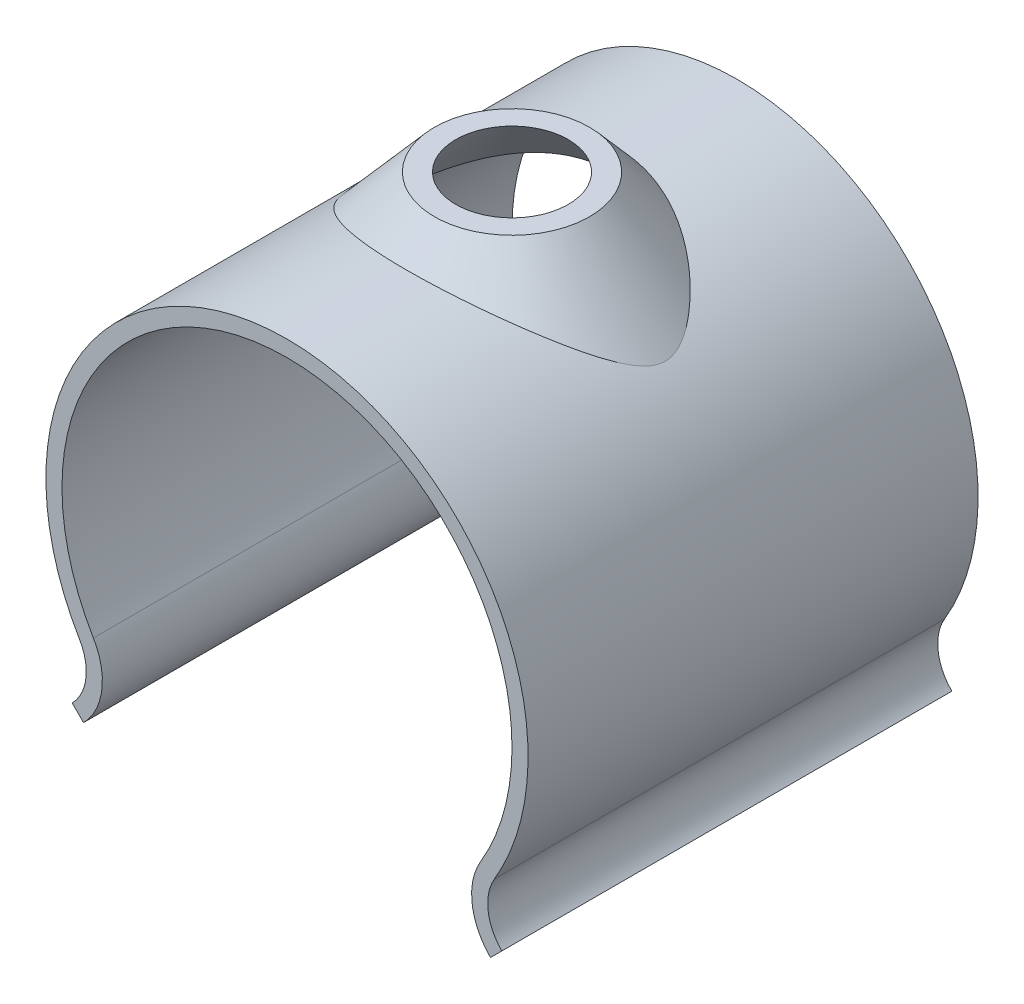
ISO-10303-21;
HEADER;
FILE_DESCRIPTION(('STEP AP214'),'2;1');
FILE_NAME('part.step','',(''),(''),'','','');
FILE_SCHEMA(('AUTOMOTIVE_DESIGN { 1 0 10303 214 1 1 1 1 }'));
ENDSEC;
DATA;
#1=APPLICATION_CONTEXT('core data for automotive mechanical design processes');
#2=APPLICATION_PROTOCOL_DEFINITION('international standard','automotive_design',2000,#1);
#3=PRODUCT_CONTEXT('',#1,'mechanical');
#4=PRODUCT('Part','Part','',(#3));
#5=PRODUCT_RELATED_PRODUCT_CATEGORY('part','',(#4));
#6=PRODUCT_DEFINITION_FORMATION('','',#4);
#7=PRODUCT_DEFINITION_CONTEXT('part definition',#1,'design');
#8=PRODUCT_DEFINITION('design','',#6,#7);
#9=PRODUCT_DEFINITION_SHAPE('','',#8);
#10=(LENGTH_UNIT() NAMED_UNIT(*) SI_UNIT(.MILLI.,.METRE.));
#11=(NAMED_UNIT(*) PLANE_ANGLE_UNIT() SI_UNIT($,.RADIAN.));
#12=(NAMED_UNIT(*) SI_UNIT($,.STERADIAN.) SOLID_ANGLE_UNIT());
#13=UNCERTAINTY_MEASURE_WITH_UNIT(LENGTH_MEASURE(1.E-05),#10,'distance_accuracy_value','');
#14=(GEOMETRIC_REPRESENTATION_CONTEXT(3) GLOBAL_UNCERTAINTY_ASSIGNED_CONTEXT((#13)) GLOBAL_UNIT_ASSIGNED_CONTEXT((#10,
#11,#12)) REPRESENTATION_CONTEXT('',''));
#15=CARTESIAN_POINT('',(0.,0.,0.));
#16=DIRECTION('',(0.,0.,1.));
#17=DIRECTION('',(1.,0.,0.));
#18=AXIS2_PLACEMENT_3D('',#15,#16,#17);
#19=CARTESIAN_POINT('',(0.,0.,11.1125));
#20=DIRECTION('',(0.,0.,-1.));
#21=DIRECTION('',(-1.,0.,0.));
#22=AXIS2_PLACEMENT_3D('',#19,#20,#21);
#23=CYLINDRICAL_SURFACE('',#22,11.1125);
#24=CARTESIAN_POINT('',(0.,0.,-11.1125));
#25=DIRECTION('',(0.,0.,-1.));
#26=DIRECTION('',(1.,0.,0.));
#27=AXIS2_PLACEMENT_3D('',#24,#25,#26);
#28=CIRCLE('',#27,11.1125);
#29=CARTESIAN_POINT('',(-9.56177074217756,-5.66217242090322,-11.1125));
#30=VERTEX_POINT('',#29);
#31=CARTESIAN_POINT('',(9.56177074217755,-5.66217242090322,-11.1125));
#32=VERTEX_POINT('',#31);
#33=EDGE_CURVE('E145',#30,#32,#28,.T.);
#34=ORIENTED_EDGE('',*,*,#33,.T.);
#35=DIRECTION('',(0.,0.,-1.));
#36=VECTOR('',#35,1.);
#37=CARTESIAN_POINT('',(9.56177074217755,-5.66217242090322,11.1125));
#38=LINE('',#37,#36);
#39=CARTESIAN_POINT('',(9.56177074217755,-5.66217242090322,11.1125));
#40=VERTEX_POINT('',#39);
#41=EDGE_CURVE('E156',#40,#32,#38,.T.);
#42=ORIENTED_EDGE('',*,*,#41,.F.);
#43=CARTESIAN_POINT('',(0.,0.,11.1125));
#44=DIRECTION('',(0.,0.,-1.));
#45=DIRECTION('',(1.,0.,0.));
#46=AXIS2_PLACEMENT_3D('',#43,#44,#45);
#47=CIRCLE('',#46,11.1125);
#48=CARTESIAN_POINT('',(-9.56177074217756,-5.66217242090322,11.1125));
#49=VERTEX_POINT('',#48);
#50=EDGE_CURVE('E182',#49,#40,#47,.T.);
#51=ORIENTED_EDGE('',*,*,#50,.F.);
#52=DIRECTION('',(0.,0.,-1.));
#53=VECTOR('',#52,1.);
#54=CARTESIAN_POINT('',(-9.56177074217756,-5.66217242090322,11.1125));
#55=LINE('',#54,#53);
#56=EDGE_CURVE('E159',#49,#30,#55,.T.);
#57=ORIENTED_EDGE('',*,*,#56,.T.);
#58=EDGE_LOOP('',(#34,#42,#51,#57));
#59=FACE_BOUND('',#58,.T.);
#60=CARTESIAN_POINT('',(-4.69885032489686,10.070176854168,-3.32137443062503));
#61=CARTESIAN_POINT('',(-4.51894106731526,10.1541328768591,-3.4494470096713));
#62=CARTESIAN_POINT('',(-4.33307176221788,10.2349816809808,-3.57105309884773));
#63=CARTESIAN_POINT('',(-3.94978434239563,10.3889102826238,-3.8004561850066));
#64=CARTESIAN_POINT('',(-3.75236343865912,10.4619881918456,-3.90824982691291));
#65=CARTESIAN_POINT('',(-3.34699256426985,10.5986331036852,-4.10855290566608));
#66=CARTESIAN_POINT('',(-3.1390525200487,10.6622088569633,-4.20107641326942));
#67=CARTESIAN_POINT('',(-2.71355634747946,10.7783507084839,-4.36937212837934));
#68=CARTESIAN_POINT('',(-2.49600361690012,10.8309206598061,-4.44515019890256));
#69=CARTESIAN_POINT('',(-2.10047526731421,10.913627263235,-4.56402933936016));
#70=CARTESIAN_POINT('',(-1.92405137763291,10.9461570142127,-4.61065313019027));
#71=CARTESIAN_POINT('',(-1.56715952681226,11.0029220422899,-4.69188318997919));
#72=CARTESIAN_POINT('',(-1.38669235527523,11.0271589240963,-4.72649178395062));
#73=CARTESIAN_POINT('',(-1.02295028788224,11.0668277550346,-4.78308248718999));
#74=CARTESIAN_POINT('',(-0.839677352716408,11.0822655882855,-4.80507303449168));
#75=CARTESIAN_POINT('',(-0.47148773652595,11.1040245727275,-4.83605619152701));
#76=CARTESIAN_POINT('',(-0.286571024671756,11.1103455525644,-4.84504855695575));
#77=CARTESIAN_POINT('',(0.0837987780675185,11.1137294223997,-4.84986335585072));
#78=CARTESIAN_POINT('',(0.269252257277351,11.1107783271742,-4.8456658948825));
#79=CARTESIAN_POINT('',(0.639012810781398,11.0956549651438,-4.82413991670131));
#80=CARTESIAN_POINT('',(0.823319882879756,11.083482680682,-4.80681137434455));
#81=CARTESIAN_POINT('',(1.18950320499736,11.0501832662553,-4.75934560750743));
#82=CARTESIAN_POINT('',(1.37137874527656,11.029053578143,-4.72920472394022));
#83=CARTESIAN_POINT('',(1.73144346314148,10.97828881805,-4.65665264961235));
#84=CARTESIAN_POINT('',(1.90963259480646,10.9486536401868,-4.61424130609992));
#85=CARTESIAN_POINT('',(2.25983214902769,10.8817423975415,-4.51823636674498));
#86=CARTESIAN_POINT('',(2.43188194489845,10.8445327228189,-4.46473986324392));
#87=CARTESIAN_POINT('',(2.77057723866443,10.7629901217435,-4.34710216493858));
#88=CARTESIAN_POINT('',(2.93722093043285,10.7186548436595,-4.28295745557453));
#89=CARTESIAN_POINT('',(3.42820149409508,10.5759646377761,-4.07563282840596));
#90=CARTESIAN_POINT('',(3.74363660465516,10.467915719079,-3.91754873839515));
#91=CARTESIAN_POINT('',(4.22043144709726,10.2815975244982,-3.64075521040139));
#92=CARTESIAN_POINT('',(4.39108447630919,10.2097569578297,-3.533204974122));
#93=CARTESIAN_POINT('',(4.72264600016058,10.0606782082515,-3.30732873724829));
#94=CARTESIAN_POINT('',(4.88355573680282,9.98344071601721,-3.18900411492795));
#95=CARTESIAN_POINT('',(5.19519054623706,9.82487820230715,-2.94194044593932));
#96=CARTESIAN_POINT('',(5.34590977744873,9.74355088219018,-2.8131955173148));
#97=CARTESIAN_POINT('',(5.63623209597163,9.57853971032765,-2.5452886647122));
#98=CARTESIAN_POINT('',(5.77584053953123,9.49485702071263,-2.4061318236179));
#99=CARTESIAN_POINT('',(6.05407481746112,9.32013381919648,-2.10404721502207));
#100=CARTESIAN_POINT('',(6.19160892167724,9.22907237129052,-1.94010432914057));
#101=CARTESIAN_POINT('',(6.38369761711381,9.09627220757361,-1.68191908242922));
#102=CARTESIAN_POINT('',(6.44531752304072,9.05266878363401,-1.59388282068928));
#103=CARTESIAN_POINT('',(6.56280246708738,8.96785949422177,-1.4129774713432));
#104=CARTESIAN_POINT('',(6.6186709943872,8.92665218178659,-1.32011136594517));
#105=CARTESIAN_POINT('',(6.72512367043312,8.84674858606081,-1.12488451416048));
#106=CARTESIAN_POINT('',(6.77541535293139,8.80821374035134,-1.02229440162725));
#107=CARTESIAN_POINT('',(6.86504109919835,8.73854016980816,-0.809962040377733));
#108=CARTESIAN_POINT('',(6.90438959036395,8.70739171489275,-0.700229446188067));
#109=CARTESIAN_POINT('',(6.96140594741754,8.66184521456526,-0.495966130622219));
#110=CARTESIAN_POINT('',(6.98181896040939,8.64535535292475,-0.402704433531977));
#111=CARTESIAN_POINT('',(7.01007492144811,8.62246241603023,-0.213152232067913));
#112=CARTESIAN_POINT('',(7.01794540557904,8.61603724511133,-0.116868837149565));
#113=CARTESIAN_POINT('',(7.01987237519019,8.61446759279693,0.0762667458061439));
#114=CARTESIAN_POINT('',(7.01388227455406,8.6193611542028,0.173119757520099));
#115=CARTESIAN_POINT('',(6.98900839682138,8.63954025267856,0.364091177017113));
#116=CARTESIAN_POINT('',(6.97009957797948,8.65484597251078,0.458203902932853));
#117=CARTESIAN_POINT('',(6.91011553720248,8.70287405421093,0.686848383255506));
#118=CARTESIAN_POINT('',(6.86272145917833,8.74045388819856,0.818626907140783));
#119=CARTESIAN_POINT('',(6.75265934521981,8.82576456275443,1.07218308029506));
#120=CARTESIAN_POINT('',(6.6899315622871,8.87353501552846,1.19391905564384));
#121=CARTESIAN_POINT('',(6.54690100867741,8.97967111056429,1.44120031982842));
#122=CARTESIAN_POINT('',(6.46544623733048,9.03862234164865,1.56581226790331));
#123=CARTESIAN_POINT('',(6.29305078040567,9.15949236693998,1.80685146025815));
#124=CARTESIAN_POINT('',(6.20209946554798,9.22141444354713,1.92326928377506));
#125=CARTESIAN_POINT('',(6.01232233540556,9.34625975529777,2.14934874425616));
#126=CARTESIAN_POINT('',(5.91348139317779,9.40918471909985,2.25899665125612));
#127=CARTESIAN_POINT('',(5.70902383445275,9.53462686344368,2.47204638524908));
#128=CARTESIAN_POINT('',(5.60340562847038,9.59714394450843,2.57544673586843));
#129=CARTESIAN_POINT('',(5.32671230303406,9.75454245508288,2.83111236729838));
#130=CARTESIAN_POINT('',(5.15132393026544,9.84850087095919,2.97931002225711));
#131=CARTESIAN_POINT('',(4.78682738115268,10.0307288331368,3.26185791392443));
#132=CARTESIAN_POINT('',(4.59771257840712,10.1189955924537,3.39620138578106));
#133=CARTESIAN_POINT('',(4.20691734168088,10.2875993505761,3.64992852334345));
#134=CARTESIAN_POINT('',(4.00526194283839,10.3679513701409,3.76934064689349));
#135=CARTESIAN_POINT('',(3.58987542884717,10.5189946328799,3.99210491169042));
#136=CARTESIAN_POINT('',(3.37614949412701,10.5896899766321,4.09546387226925));
#137=CARTESIAN_POINT('',(2.98538270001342,10.7054737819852,4.2638687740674));
#138=CARTESIAN_POINT('',(2.81047860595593,10.752786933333,4.33235765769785));
#139=CARTESIAN_POINT('',(2.45463090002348,10.8395553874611,4.45758041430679));
#140=CARTESIAN_POINT('',(2.27368862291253,10.8790124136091,4.51431686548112));
#141=CARTESIAN_POINT('',(1.90678554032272,10.9492779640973,4.61513950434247));
#142=CARTESIAN_POINT('',(1.72082805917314,10.9800920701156,4.6592338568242));
#143=CARTESIAN_POINT('',(1.34493976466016,11.03244282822,4.73404411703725));
#144=CARTESIAN_POINT('',(1.15500893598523,11.0539794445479,4.76475997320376));
#145=CARTESIAN_POINT('',(0.77165898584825,11.0873524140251,4.8123233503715));
#146=CARTESIAN_POINT('',(0.578227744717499,11.0991431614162,4.82910567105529));
#147=CARTESIAN_POINT('',(0.190296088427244,11.1125653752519,4.8482083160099));
#148=CARTESIAN_POINT('',(-0.00420432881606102,11.1141968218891,4.85052861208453));
#149=CARTESIAN_POINT('',(-0.392673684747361,11.1072593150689,4.84065694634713));
#150=CARTESIAN_POINT('',(-0.586642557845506,11.0986891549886,4.82846326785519));
#151=CARTESIAN_POINT('',(-0.972437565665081,11.0715587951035,4.78981942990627));
#152=CARTESIAN_POINT('',(-1.16426376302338,11.0529988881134,4.76336968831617));
#153=CARTESIAN_POINT('',(-1.53115836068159,11.007950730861,4.69905845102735));
#154=CARTESIAN_POINT('',(-1.70646772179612,10.9821000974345,4.66211344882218));
#155=CARTESIAN_POINT('',(-2.05302484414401,10.9226217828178,4.57691739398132));
#156=CARTESIAN_POINT('',(-2.22427120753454,10.8889914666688,4.52866251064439));
#157=CARTESIAN_POINT('',(-2.56173639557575,10.8145740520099,4.42156464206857));
#158=CARTESIAN_POINT('',(-2.7279570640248,10.7737896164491,4.36272559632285));
#159=CARTESIAN_POINT('',(-3.05484510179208,10.6857030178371,4.23515068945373));
#160=CARTESIAN_POINT('',(-3.21551006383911,10.6383980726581,4.1664106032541));
#161=CARTESIAN_POINT('',(-3.54755391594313,10.532617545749,4.0119284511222));
#162=CARTESIAN_POINT('',(-3.71824422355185,10.4734885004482,3.92515461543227));
#163=CARTESIAN_POINT('',(-4.05162396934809,10.3490899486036,3.74124457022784));
#164=CARTESIAN_POINT('',(-4.21431228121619,10.2838195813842,3.64410690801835));
#165=CARTESIAN_POINT('',(-4.53148271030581,10.1480597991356,3.44005049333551));
#166=CARTESIAN_POINT('',(-4.68595358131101,10.0775635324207,3.33311885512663));
#167=CARTESIAN_POINT('',(-4.98608034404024,9.93249355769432,3.11005393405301));
#168=CARTESIAN_POINT('',(-5.13173641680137,9.85791993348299,2.99392084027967));
#169=CARTESIAN_POINT('',(-5.3868790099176,9.72039158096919,2.77555507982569));
#170=CARTESIAN_POINT('',(-5.49797253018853,9.65792749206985,2.67488480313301));
#171=CARTESIAN_POINT('',(-5.71362961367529,9.53192926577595,2.46741705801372));
#172=CARTESIAN_POINT('',(-5.81819404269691,9.46839527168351,2.36062040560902));
#173=CARTESIAN_POINT('',(-6.01985784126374,9.34147322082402,2.14067427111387));
#174=CARTESIAN_POINT('',(-6.11697523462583,9.27808519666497,2.0275413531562));
#175=CARTESIAN_POINT('',(-6.30276736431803,9.15288381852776,1.79379054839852));
#176=CARTESIAN_POINT('',(-6.39144847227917,9.09106930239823,1.67317842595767));
#177=CARTESIAN_POINT('',(-6.54266393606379,8.98266072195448,1.44596268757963));
#178=CARTESIAN_POINT('',(-6.60699856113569,8.93536850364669,1.34090355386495));
#179=CARTESIAN_POINT('',(-6.72631027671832,8.84589974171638,1.12328159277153));
#180=CARTESIAN_POINT('',(-6.78128348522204,8.80372532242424,1.01071567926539));
#181=CARTESIAN_POINT('',(-6.87092109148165,8.73389160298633,0.79359178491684));
#182=CARTESIAN_POINT('',(-6.90736499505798,8.70501933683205,0.69018786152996));
#183=CARTESIAN_POINT('',(-6.96644976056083,8.65781133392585,0.477264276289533));
#184=CARTESIAN_POINT('',(-6.98913531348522,8.63944149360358,0.367765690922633));
#185=CARTESIAN_POINT('',(-7.01442198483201,8.61891918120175,0.164672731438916));
#186=CARTESIAN_POINT('',(-7.01986017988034,8.61447750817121,0.0716802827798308));
#187=CARTESIAN_POINT('',(-7.01793952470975,8.61604205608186,-0.114065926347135));
#188=CARTESIAN_POINT('',(-7.01058167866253,8.62204745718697,-0.206819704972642));
#189=CARTESIAN_POINT('',(-6.98093181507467,8.64607885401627,-0.411991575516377));
#190=CARTESIAN_POINT('',(-6.95540253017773,8.66670548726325,-0.523613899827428));
#191=CARTESIAN_POINT('',(-6.89054658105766,8.71835470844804,-0.740372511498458));
#192=CARTESIAN_POINT('',(-6.85116678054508,8.74941731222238,-0.845481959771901));
#193=CARTESIAN_POINT('',(-6.76467847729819,8.81644131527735,-1.04426378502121));
#194=CARTESIAN_POINT('',(-6.71802104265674,8.85210328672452,-1.1382416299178));
#195=CARTESIAN_POINT('',(-6.61797703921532,8.92714811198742,-1.32103374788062));
#196=CARTESIAN_POINT('',(-6.56458368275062,8.96653470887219,-1.4098426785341));
#197=CARTESIAN_POINT('',(-6.39639981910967,9.08805438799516,-1.66994994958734));
#198=CARTESIAN_POINT('',(-6.27374791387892,9.17343436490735,-1.83463055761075));
#199=CARTESIAN_POINT('',(-6.0397043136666,9.32873887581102,-2.11862051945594));
#200=CARTESIAN_POINT('',(-5.93099190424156,9.39832679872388,-2.24040316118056));
#201=CARTESIAN_POINT('',(-5.70522882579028,9.53706314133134,-2.4763274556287));
#202=CARTESIAN_POINT('',(-5.58817505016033,9.60621138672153,-2.59046623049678));
#203=CARTESIAN_POINT('',(-5.22576060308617,9.81101036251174,-2.92212951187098));
#204=CARTESIAN_POINT('',(-4.96902602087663,9.9440973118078,-3.12904359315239));
#205=CARTESIAN_POINT('',(-4.69885032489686,10.070176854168,-3.32137443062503));
#206=B_SPLINE_CURVE_WITH_KNOTS('',3,(#60,#61,#62,#63,#64,#65,#66,#67,#68,#69,#70,#71,#72,#73,
#74,#75,#76,#77,#78,#79,#80,#81,#82,#83,#84,#85,#86,#87,#88,#89,#90,#91,#92,#93,#94,#95,#96,#97,
#98,#99,#100,#101,#102,#103,#104,#105,#106,#107,#108,#109,#110,#111,#112,#113,#114,#115,#116,
#117,#118,#119,#120,#121,#122,#123,#124,#125,#126,#127,#128,#129,#130,#131,#132,#133,#134,#135,
#136,#137,#138,#139,#140,#141,#142,#143,#144,#145,#146,#147,#148,#149,#150,#151,#152,#153,#154,
#155,#156,#157,#158,#159,#160,#161,#162,#163,#164,#165,#166,#167,#168,#169,#170,#171,#172,#173,
#174,#175,#176,#177,#178,#179,#180,#181,#182,#183,#184,#185,#186,#187,#188,#189,#190,#191,#192,
#193,#194,#195,#196,#197,#198,#199,#200,#201,#202,#203,#204,#205),.UNSPECIFIED.,.T.,.F.,(4,2,2,
2,2,2,2,2,2,2,2,2,2,2,2,2,2,2,2,2,2,2,2,2,2,2,2,2,2,2,2,2,2,2,2,2,2,2,2,2,2,2,2,2,2,2,2,2,2,2,2,
2,2,2,2,2,2,2,2,2,2,2,2,2,2,2,2,2,2,2,2,2,4),(0.,0.708452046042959,1.41707585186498,
2.12504300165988,2.83276187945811,3.38826308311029,3.94365673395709,4.49867854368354,
5.05371078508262,5.60958059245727,6.16545146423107,6.7214811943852,7.27751784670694,
7.828875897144,8.380416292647,9.48334391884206,10.1252867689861,10.7671476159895,
11.4093733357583,12.0512875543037,12.7477524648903,13.0954635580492,13.4429624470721,
13.8040641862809,14.164687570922,14.454201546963,14.7430790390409,15.0329288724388,
15.3233421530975,15.7558451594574,16.1900610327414,16.6696931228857,17.1498679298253,
17.630986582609,18.1122184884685,18.8556201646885,19.5993831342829,20.3417062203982,
21.0837131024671,21.6642650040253,22.2446894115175,22.8247381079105,23.4047890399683,
23.9875391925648,24.5702904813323,25.1531107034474,25.7359138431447,26.2783815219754,
26.8210332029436,27.3634833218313,27.9061656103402,28.5068120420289,29.1075427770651,
29.7090755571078,30.3105959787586,30.7976076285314,31.2845545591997,31.7702830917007,
32.2556418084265,32.6510807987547,33.0466833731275,33.3857584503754,33.7237261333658,
34.0020738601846,34.2803997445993,34.6274086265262,34.9757635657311,35.3077205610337,
35.6400147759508,36.3056418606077,36.8376998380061,37.3699570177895,38.4338629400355),.UNSPECIFIED.);
#207=CARTESIAN_POINT('',(-4.69885032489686,10.070176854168,-3.32137443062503));
#208=VERTEX_POINT('',#207);
#209=EDGE_CURVE('E191',#208,#208,#206,.T.);
#210=ORIENTED_EDGE('',*,*,#209,.F.);
#211=EDGE_LOOP('',(#210));
#212=FACE_BOUND('',#211,.T.);
#213=ADVANCED_FACE('F35',(#59,#212),#23,.F.);
#214=CARTESIAN_POINT('',(0.,13.49375,0.));
#215=DIRECTION('',(0.,-1.,0.));
#216=DIRECTION('',(0.,0.,-1.));
#217=AXIS2_PLACEMENT_3D('',#214,#215,#216);
#218=PLANE('',#217);
#219=CARTESIAN_POINT('',(0.,13.49375,0.));
#220=DIRECTION('',(0.,-1.,0.));
#221=DIRECTION('',(0.,0.,-1.));
#222=AXIS2_PLACEMENT_3D('',#219,#220,#221);
#223=CIRCLE('',#222,3.82985406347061);
#224=CARTESIAN_POINT('',(0.,13.49375,-3.82985406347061));
#225=VERTEX_POINT('',#224);
#226=EDGE_CURVE('E141',#225,#225,#223,.T.);
#227=ORIENTED_EDGE('',*,*,#226,.F.);
#228=EDGE_LOOP('',(#227));
#229=FACE_BOUND('',#228,.T.);
#230=CARTESIAN_POINT('',(0.,13.49375,0.));
#231=DIRECTION('',(0.,-1.,0.));
#232=DIRECTION('',(0.,0.,-1.));
#233=AXIS2_PLACEMENT_3D('',#230,#231,#232);
#234=CIRCLE('',#233,2.778125);
#235=CARTESIAN_POINT('',(0.,13.49375,-2.778125));
#236=VERTEX_POINT('',#235);
#237=EDGE_CURVE('E198',#236,#236,#234,.T.);
#238=ORIENTED_EDGE('',*,*,#237,.T.);
#239=EDGE_LOOP('',(#238));
#240=FACE_BOUND('',#239,.T.);
#241=ADVANCED_FACE('F211',(#229,#240),#218,.F.);
#242=CARTESIAN_POINT('',(0.,0.,11.1125));
#243=DIRECTION('',(0.,0.,-1.));
#244=DIRECTION('',(-1.,0.,0.));
#245=AXIS2_PLACEMENT_3D('',#242,#243,#244);
#246=CYLINDRICAL_SURFACE('',#245,11.90625);
#247=CARTESIAN_POINT('',(0.,0.,-11.1125));
#248=DIRECTION('',(0.,0.,1.));
#249=DIRECTION('',(1.,0.,0.));
#250=AXIS2_PLACEMENT_3D('',#247,#248,#249);
#251=CIRCLE('',#250,11.90625);
#252=CARTESIAN_POINT('',(10.2447543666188,-6.0666133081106,-11.1125));
#253=VERTEX_POINT('',#252);
#254=CARTESIAN_POINT('',(-10.2447543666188,-6.0666133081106,-11.1125));
#255=VERTEX_POINT('',#254);
#256=EDGE_CURVE('E91',#253,#255,#251,.T.);
#257=ORIENTED_EDGE('',*,*,#256,.T.);
#258=DIRECTION('',(0.,0.,-1.));
#259=VECTOR('',#258,1.);
#260=CARTESIAN_POINT('',(-10.2447543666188,-6.0666133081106,11.1125));
#261=LINE('',#260,#259);
#262=CARTESIAN_POINT('',(-10.2447543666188,-6.0666133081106,11.1125));
#263=VERTEX_POINT('',#262);
#264=EDGE_CURVE('E133',#263,#255,#261,.T.);
#265=ORIENTED_EDGE('',*,*,#264,.F.);
#266=CARTESIAN_POINT('',(0.,0.,11.1125));
#267=DIRECTION('',(0.,0.,1.));
#268=DIRECTION('',(1.,0.,0.));
#269=AXIS2_PLACEMENT_3D('',#266,#267,#268);
#270=CIRCLE('',#269,11.90625);
#271=CARTESIAN_POINT('',(10.2447543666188,-6.0666133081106,11.1125));
#272=VERTEX_POINT('',#271);
#273=EDGE_CURVE('E56',#272,#263,#270,.T.);
#274=ORIENTED_EDGE('',*,*,#273,.F.);
#275=DIRECTION('',(0.,0.,-1.));
#276=VECTOR('',#275,1.);
#277=CARTESIAN_POINT('',(10.2447543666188,-6.0666133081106,11.1125));
#278=LINE('',#277,#276);
#279=EDGE_CURVE('E129',#272,#253,#278,.T.);
#280=ORIENTED_EDGE('',*,*,#279,.T.);
#281=EDGE_LOOP('',(#257,#265,#274,#280));
#282=FACE_BOUND('',#281,.T.);
#283=CARTESIAN_POINT('',(-5.07504120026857,10.7704570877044,-3.55653666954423));
#284=CARTESIAN_POINT('',(-5.23935821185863,10.6930321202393,-3.43933677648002));
#285=CARTESIAN_POINT('',(-5.39897575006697,10.6132217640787,-3.31720545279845));
#286=CARTESIAN_POINT('',(-5.70841276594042,10.4500419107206,-3.06330845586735));
#287=CARTESIAN_POINT('',(-5.85823382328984,10.3666729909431,-2.93154434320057));
#288=CARTESIAN_POINT('',(-6.14703720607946,10.1980692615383,-2.65849711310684));
#289=CARTESIAN_POINT('',(-6.28604393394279,10.1128392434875,-2.51723685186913));
#290=CARTESIAN_POINT('',(-6.55222696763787,9.94243329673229,-2.22406713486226));
#291=CARTESIAN_POINT('',(-6.67941296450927,9.85725738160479,-2.07216658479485));
#292=CARTESIAN_POINT('',(-6.88368026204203,9.71515962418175,-1.80234230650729));
#293=CARTESIAN_POINT('',(-6.96444079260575,9.65734459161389,-1.68768862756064));
#294=CARTESIAN_POINT('',(-7.11699716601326,9.5454745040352,-1.45022009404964));
#295=CARTESIAN_POINT('',(-7.18877013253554,9.49142919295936,-1.327385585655));
#296=CARTESIAN_POINT('',(-7.32055156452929,9.39016873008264,-1.07007739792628));
#297=CARTESIAN_POINT('',(-7.38037154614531,9.34306568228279,-0.935459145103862));
#298=CARTESIAN_POINT('',(-7.47968026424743,9.26376143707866,-0.65494186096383));
#299=CARTESIAN_POINT('',(-7.519294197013,9.23146860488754,-0.50911889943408));
#300=CARTESIAN_POINT('',(-7.56009597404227,9.19805293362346,-0.262943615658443));
#301=CARTESIAN_POINT('',(-7.56997102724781,9.18990381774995,-0.165047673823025));
#302=CARTESIAN_POINT('',(-7.57606957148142,9.18487809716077,0.0314567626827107));
#303=CARTESIAN_POINT('',(-7.57229986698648,9.18799587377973,0.13006487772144));
#304=CARTESIAN_POINT('',(-7.55180381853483,9.20484632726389,0.324396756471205));
#305=CARTESIAN_POINT('',(-7.53514080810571,9.2185271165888,0.420132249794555));
#306=CARTESIAN_POINT('',(-7.491154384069,9.25430723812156,0.607507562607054));
#307=CARTESIAN_POINT('',(-7.46381247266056,9.27642117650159,0.699139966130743));
#308=CARTESIAN_POINT('',(-7.37167671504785,9.35002972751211,0.961180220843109));
#309=CARTESIAN_POINT('',(-7.29575055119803,9.40967824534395,1.12525601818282));
#310=CARTESIAN_POINT('',(-7.12552129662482,9.53925513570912,1.43930645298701));
#311=CARTESIAN_POINT('',(-7.03113274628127,9.60923092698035,1.5892105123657));
#312=CARTESIAN_POINT('',(-6.8131650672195,9.76526216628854,1.90160859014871));
#313=CARTESIAN_POINT('',(-6.68733710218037,9.8520736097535,2.06214087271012));
#314=CARTESIAN_POINT('',(-6.42243303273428,10.02678660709,2.37138164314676));
#315=CARTESIAN_POINT('',(-6.28334241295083,10.1146892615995,2.52007684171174));
#316=CARTESIAN_POINT('',(-5.99364547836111,10.289004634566,2.80704325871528));
#317=CARTESIAN_POINT('',(-5.84302867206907,10.3754159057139,2.94530474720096));
#318=CARTESIAN_POINT('',(-5.53138135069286,10.5448602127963,3.21161578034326));
#319=CARTESIAN_POINT('',(-5.37035518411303,10.6278946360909,3.33966953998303));
#320=CARTESIAN_POINT('',(-5.01970491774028,10.7983097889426,3.59926957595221));
#321=CARTESIAN_POINT('',(-4.82889989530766,10.885131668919,3.72959354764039));
#322=CARTESIAN_POINT('',(-4.4355092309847,11.0512736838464,3.97668083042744));
#323=CARTESIAN_POINT('',(-4.23292106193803,11.1305921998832,4.09344121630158));
#324=CARTESIAN_POINT('',(-3.81706299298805,11.2799614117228,4.31190274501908));
#325=CARTESIAN_POINT('',(-3.60381574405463,11.3500306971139,4.41363414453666));
#326=CARTESIAN_POINT('',(-3.16719048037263,11.4795253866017,4.60079954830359));
#327=CARTESIAN_POINT('',(-2.94381534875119,11.5389537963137,4.68623815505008));
#328=CARTESIAN_POINT('',(-2.52990832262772,11.6359319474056,4.8252323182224));
#329=CARTESIAN_POINT('',(-2.34084293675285,11.6754952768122,4.88176117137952));
#330=CARTESIAN_POINT('',(-1.95775801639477,11.7458024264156,4.98203503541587));
#331=CARTESIAN_POINT('',(-1.76373941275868,11.7765478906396,5.02578242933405));
#332=CARTESIAN_POINT('',(-1.37194276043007,11.8285925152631,5.09974989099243));
#333=CARTESIAN_POINT('',(-1.1741658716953,11.8498945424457,5.12997406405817));
#334=CARTESIAN_POINT('',(-0.776146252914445,11.882602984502,5.17635453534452));
#335=CARTESIAN_POINT('',(-0.575903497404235,11.8940092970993,5.19251068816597));
#336=CARTESIAN_POINT('',(-0.173998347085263,11.9066798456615,5.21045640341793));
#337=CARTESIAN_POINT('',(0.0276662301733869,11.9079211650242,5.21221350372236));
#338=CARTESIAN_POINT('',(0.430401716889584,11.9001726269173,5.2012403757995));
#339=CARTESIAN_POINT('',(0.631472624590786,11.8911827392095,5.18851010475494));
#340=CARTESIAN_POINT('',(1.03152948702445,11.8631764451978,5.14881235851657));
#341=CARTESIAN_POINT('',(1.23051502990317,11.8441580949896,5.12184212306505));
#342=CARTESIAN_POINT('',(1.62495769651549,11.7965151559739,5.05417427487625));
#343=CARTESIAN_POINT('',(1.82041481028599,11.767890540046,5.01347662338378));
#344=CARTESIAN_POINT('',(2.20146657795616,11.7025089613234,4.92031595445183));
#345=CARTESIAN_POINT('',(2.38718534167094,11.665987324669,4.86819289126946));
#346=CARTESIAN_POINT('',(2.75326429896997,11.5850542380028,4.75236047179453));
#347=CARTESIAN_POINT('',(2.93362270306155,11.5406401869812,4.68864729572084));
#348=CARTESIAN_POINT('',(3.28821010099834,11.4446584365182,4.55045248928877));
#349=CARTESIAN_POINT('',(3.46243846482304,11.3930900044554,4.47596975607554));
#350=CARTESIAN_POINT('',(3.80421851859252,11.2835687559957,4.31702937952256));
#351=CARTESIAN_POINT('',(3.97176927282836,11.225615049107,4.23257034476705));
#352=CARTESIAN_POINT('',(4.32436192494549,11.0950043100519,4.04105260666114));
#353=CARTESIAN_POINT('',(4.50826104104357,11.0214454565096,3.932503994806));
#354=CARTESIAN_POINT('',(4.86615647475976,10.8681742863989,3.70412396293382));
#355=CARTESIAN_POINT('',(5.04015390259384,10.7884626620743,3.58429381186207));
#356=CARTESIAN_POINT('',(5.37803863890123,10.6240668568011,3.3338128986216));
#357=CARTESIAN_POINT('',(5.54191479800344,10.5393773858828,3.20315056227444));
#358=CARTESIAN_POINT('',(5.85868311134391,10.3666390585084,2.93134571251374));
#359=CARTESIAN_POINT('',(6.01157904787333,10.2785913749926,2.79020684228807));
#360=CARTESIAN_POINT('',(6.34307261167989,10.0782143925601,2.45958413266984));
#361=CARTESIAN_POINT('',(6.51830468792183,9.96540968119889,2.26693968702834));
#362=CARTESIAN_POINT('',(6.76357116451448,9.79911807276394,1.96266730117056));
#363=CARTESIAN_POINT('',(6.84232910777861,9.74422480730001,1.85879937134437));
#364=CARTESIAN_POINT('',(6.992821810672,9.63679052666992,1.64497348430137));
#365=CARTESIAN_POINT('',(7.06456134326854,9.58424792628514,1.53501974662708));
#366=CARTESIAN_POINT('',(7.19392223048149,9.48748095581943,1.31631406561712));
#367=CARTESIAN_POINT('',(7.25220169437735,9.44292793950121,1.2081034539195));
#368=CARTESIAN_POINT('',(7.35825030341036,9.36052516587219,0.984045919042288));
#369=CARTESIAN_POINT('',(7.40602392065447,9.32267255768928,0.868202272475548));
#370=CARTESIAN_POINT('',(7.47902296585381,9.26416726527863,0.65036577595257));
#371=CARTESIAN_POINT('',(7.50678348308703,9.24162893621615,0.54976772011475));
#372=CARTESIAN_POINT('',(7.54893874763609,9.20722967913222,0.344137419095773));
#373=CARTESIAN_POINT('',(7.56337155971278,9.19533834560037,0.239118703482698));
#374=CARTESIAN_POINT('',(7.57653399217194,9.18449888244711,0.0264891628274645));
#375=CARTESIAN_POINT('',(7.57513627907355,9.18565570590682,-0.081135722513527));
#376=CARTESIAN_POINT('',(7.55659735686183,9.20090986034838,-0.29413681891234));
#377=CARTESIAN_POINT('',(7.53942770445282,9.21503057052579,-0.399508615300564));
#378=CARTESIAN_POINT('',(7.48469253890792,9.25957453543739,-0.637868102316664));
#379=CARTESIAN_POINT('',(7.44238082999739,9.29375141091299,-0.768996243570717));
#380=CARTESIAN_POINT('',(7.34247604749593,9.37288093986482,-1.02190100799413));
#381=CARTESIAN_POINT('',(7.28482587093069,9.41787379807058,-1.14364044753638));
#382=CARTESIAN_POINT('',(7.15361897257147,9.51797884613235,-1.38909109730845));
#383=CARTESIAN_POINT('',(7.07911805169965,9.57362956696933,-1.51206315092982));
#384=CARTESIAN_POINT('',(6.92104165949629,9.68852722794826,-1.75033482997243));
#385=CARTESIAN_POINT('',(6.83745595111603,9.74777819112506,-1.86562555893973));
#386=CARTESIAN_POINT('',(6.66288481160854,9.86792866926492,-2.08999006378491));
#387=CARTESIAN_POINT('',(6.57188346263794,9.92883153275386,-2.19904956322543));
#388=CARTESIAN_POINT('',(6.38364299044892,10.0508954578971,-2.41151697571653));
#389=CARTESIAN_POINT('',(6.28640204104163,10.1120565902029,-2.51492321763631));
#390=CARTESIAN_POINT('',(6.01007254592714,10.2800931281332,-2.79338937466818));
#391=CARTESIAN_POINT('',(5.82506546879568,10.3862992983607,-2.96302406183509));
#392=CARTESIAN_POINT('',(5.43930769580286,10.5934302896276,-3.28713937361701));
#393=CARTESIAN_POINT('',(5.23854725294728,10.6943517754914,-3.44161048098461));
#394=CARTESIAN_POINT('',(4.82264185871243,10.8882252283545,-3.73446083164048));
#395=CARTESIAN_POINT('',(4.60752608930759,10.9811925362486,-3.87287124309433));
#396=CARTESIAN_POINT('',(4.16325818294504,11.157201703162,-4.13264499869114));
#397=CARTESIAN_POINT('',(3.93410375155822,11.2402419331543,-4.25400554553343));
#398=CARTESIAN_POINT('',(3.51447005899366,11.3773804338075,-4.45325439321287));
#399=CARTESIAN_POINT('',(3.32651089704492,11.4338343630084,-4.53484262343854));
#400=CARTESIAN_POINT('',(2.94345933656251,11.5383799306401,-4.68541531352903));
#401=CARTESIAN_POINT('',(2.74837129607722,11.5864765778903,-4.75440732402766));
#402=CARTESIAN_POINT('',(2.35201238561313,11.6733867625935,-4.87877070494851));
#403=CARTESIAN_POINT('',(2.1507456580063,11.7122063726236,-4.93415098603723));
#404=CARTESIAN_POINT('',(1.7430912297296,11.7797750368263,-5.03038619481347));
#405=CARTESIAN_POINT('',(1.53670353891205,11.8085241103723,-5.07124115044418));
#406=CARTESIAN_POINT('',(1.11905612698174,11.8554167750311,-5.13781563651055));
#407=CARTESIAN_POINT('',(0.907775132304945,11.8734980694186,-5.16344626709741));
#408=CARTESIAN_POINT('',(0.483208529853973,11.8983407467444,-5.19864910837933));
#409=CARTESIAN_POINT('',(0.269922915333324,11.905102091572,-5.20822126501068));
#410=CARTESIAN_POINT('',(-0.156845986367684,11.9071294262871,-5.21109206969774));
#411=CARTESIAN_POINT('',(-0.370329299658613,11.9023935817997,-5.20438812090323));
#412=CARTESIAN_POINT('',(-0.795603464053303,11.8815454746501,-5.1748518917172));
#413=CARTESIAN_POINT('',(-1.00739440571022,11.8654338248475,-5.15202048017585));
#414=CARTESIAN_POINT('',(-1.4089857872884,11.8241547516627,-5.09344049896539));
#415=CARTESIAN_POINT('',(-1.59907680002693,11.7999124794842,-5.05901039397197));
#416=CARTESIAN_POINT('',(-1.97532422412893,11.7427894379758,-4.97773093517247));
#417=CARTESIAN_POINT('',(-2.16147922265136,11.7099056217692,-4.93087720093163));
#418=CARTESIAN_POINT('',(-2.52864997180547,11.636139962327,-4.82551183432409));
#419=CARTESIAN_POINT('',(-2.70966990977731,11.5952648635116,-4.76701003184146));
#420=CARTESIAN_POINT('',(-3.06598128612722,11.5061855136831,-4.63909817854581));
#421=CARTESIAN_POINT('',(-3.24127110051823,11.4579792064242,-4.56968506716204));
#422=CARTESIAN_POINT('',(-3.71048262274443,11.3175604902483,-4.36664897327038));
#423=CARTESIAN_POINT('',(-3.99816750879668,11.2188027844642,-4.22298821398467));
#424=CARTESIAN_POINT('',(-4.55272035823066,11.0054513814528,-3.90906029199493));
#425=CARTESIAN_POINT('',(-4.81956104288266,10.89083745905,-3.73875911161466));
#426=CARTESIAN_POINT('',(-5.07504120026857,10.7704570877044,-3.55653666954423));
#427=B_SPLINE_CURVE_WITH_KNOTS('',3,(#283,#284,#285,#286,#287,#288,#289,#290,#291,#292,#293,
#294,#295,#296,#297,#298,#299,#300,#301,#302,#303,#304,#305,#306,#307,#308,#309,#310,#311,#312,
#313,#314,#315,#316,#317,#318,#319,#320,#321,#322,#323,#324,#325,#326,#327,#328,#329,#330,#331,
#332,#333,#334,#335,#336,#337,#338,#339,#340,#341,#342,#343,#344,#345,#346,#347,#348,#349,#350,
#351,#352,#353,#354,#355,#356,#357,#358,#359,#360,#361,#362,#363,#364,#365,#366,#367,#368,#369,
#370,#371,#372,#373,#374,#375,#376,#377,#378,#379,#380,#381,#382,#383,#384,#385,#386,#387,#388,
#389,#390,#391,#392,#393,#394,#395,#396,#397,#398,#399,#400,#401,#402,#403,#404,#405,#406,#407,
#408,#409,#410,#411,#412,#413,#414,#415,#416,#417,#418,#419,#420,#421,#422,#423,#424,#425,#426),
.UNSPECIFIED.,.T.,.F.,(4,2,2,2,2,2,2,2,2,2,2,2,2,2,2,2,2,2,2,2,2,2,2,2,2,2,2,2,2,2,2,2,2,2,2,2,
2,2,2,2,2,2,2,2,2,2,2,2,2,2,2,2,2,2,2,2,2,2,2,2,2,2,2,2,2,2,2,2,2,2,2,4),(0.,0.648328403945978,
1.29655200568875,1.9432677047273,2.58944843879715,3.04414885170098,3.49998406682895,
3.96252125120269,4.42215664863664,4.71688751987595,5.01147143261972,5.30461742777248,
5.59827347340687,6.16611602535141,6.73665204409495,7.4006727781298,8.06542878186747,
8.73079723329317,9.3958895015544,10.1356608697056,10.8755914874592,11.6140115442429,
12.3522226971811,12.9553984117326,13.5584615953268,14.1613415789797,14.7642277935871,
15.3684728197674,15.9727196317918,16.5770836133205,17.1814493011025,17.7698170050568,
18.3583789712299,18.9470012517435,19.535705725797,20.2126540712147,20.8895263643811,
21.5671314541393,22.2445020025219,23.0943091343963,23.5183983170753,23.9421970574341,
24.3338534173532,24.7253427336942,25.0445086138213,25.3627600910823,25.6835732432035,
26.0049660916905,26.4284458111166,26.8535246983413,27.3153468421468,27.7776948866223,
28.2410629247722,28.7045672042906,29.5211706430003,30.3382833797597,31.1537828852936,
31.9694160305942,32.6064323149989,33.2430654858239,33.8792807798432,34.5154948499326,
35.1553883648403,35.7952840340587,36.4352818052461,37.0752450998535,37.6587047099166,
38.2423703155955,38.8255454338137,39.4088844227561,40.4156095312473,41.4236308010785),.UNSPECIFIED.);
#428=CARTESIAN_POINT('',(-5.07504120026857,10.7704570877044,-3.55653666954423));
#429=VERTEX_POINT('',#428);
#430=EDGE_CURVE('E11',#429,#429,#427,.T.);
#431=ORIENTED_EDGE('',*,*,#430,.F.);
#432=EDGE_LOOP('',(#431));
#433=FACE_BOUND('',#432,.T.);
#434=ADVANCED_FACE('F214',(#282,#433),#246,.T.);
#435=CARTESIAN_POINT('',(-12.2937052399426,-7.27993596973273,11.1125));
#436=DIRECTION('',(0.,0.,-1.));
#437=DIRECTION('',(-1.,0.,0.));
#438=AXIS2_PLACEMENT_3D('',#435,#436,#437);
#439=CYLINDRICAL_SURFACE('',#438,2.38125);
#440=CARTESIAN_POINT('',(-12.2937052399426,-7.27993596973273,-11.1125));
#441=DIRECTION('',(0.,0.,-1.));
#442=DIRECTION('',(-1.,0.,0.));
#443=AXIS2_PLACEMENT_3D('',#440,#441,#442);
#444=CIRCLE('',#443,2.38125);
#445=CARTESIAN_POINT('',(-10.6099072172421,-8.96373399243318,-11.1125));
#446=VERTEX_POINT('',#445);
#447=EDGE_CURVE('E137',#255,#446,#444,.T.);
#448=ORIENTED_EDGE('',*,*,#447,.T.);
#449=DIRECTION('',(0.,0.,-1.));
#450=VECTOR('',#449,1.);
#451=CARTESIAN_POINT('',(-10.6099072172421,-8.96373399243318,11.1125));
#452=LINE('',#451,#450);
#453=CARTESIAN_POINT('',(-10.6099072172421,-8.96373399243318,11.1125));
#454=VERTEX_POINT('',#453);
#455=EDGE_CURVE('E48',#454,#446,#452,.T.);
#456=ORIENTED_EDGE('',*,*,#455,.F.);
#457=CARTESIAN_POINT('',(-12.2937052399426,-7.27993596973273,11.1125));
#458=DIRECTION('',(0.,0.,-1.));
#459=DIRECTION('',(-1.,0.,0.));
#460=AXIS2_PLACEMENT_3D('',#457,#458,#459);
#461=CIRCLE('',#460,2.38125);
#462=EDGE_CURVE('E152',#263,#454,#461,.T.);
#463=ORIENTED_EDGE('',*,*,#462,.F.);
#464=ORIENTED_EDGE('',*,*,#264,.T.);
#465=EDGE_LOOP('',(#448,#456,#463,#464));
#466=FACE_BOUND('',#465,.T.);
#467=ADVANCED_FACE('F37',(#466),#439,.F.);
#468=CARTESIAN_POINT('',(-10.0486412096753,-9.525,11.1125));
#469=DIRECTION('',(0.707106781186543,0.707106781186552,0.));
#470=DIRECTION('',(-0.707106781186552,0.707106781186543,0.));
#471=AXIS2_PLACEMENT_3D('',#468,#469,#470);
#472=PLANE('',#471);
#473=DIRECTION('',(0.707106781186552,-0.707106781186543,0.));
#474=VECTOR('',#473,1.);
#475=CARTESIAN_POINT('',(-10.0486412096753,-9.525,-11.1125));
#476=LINE('',#475,#474);
#477=CARTESIAN_POINT('',(-10.0486412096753,-9.525,-11.1125));
#478=VERTEX_POINT('',#477);
#479=EDGE_CURVE('E140',#446,#478,#476,.T.);
#480=ORIENTED_EDGE('',*,*,#479,.T.);
#481=DIRECTION('',(0.,0.,-1.));
#482=VECTOR('',#481,1.);
#483=CARTESIAN_POINT('',(-10.0486412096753,-9.525,11.1125));
#484=LINE('',#483,#482);
#485=CARTESIAN_POINT('',(-10.0486412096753,-9.525,11.1125));
#486=VERTEX_POINT('',#485);
#487=EDGE_CURVE('E162',#486,#478,#484,.T.);
#488=ORIENTED_EDGE('',*,*,#487,.F.);
#489=DIRECTION('',(0.707106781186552,-0.707106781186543,0.));
#490=VECTOR('',#489,1.);
#491=CARTESIAN_POINT('',(-10.0486412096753,-9.525,11.1125));
#492=LINE('',#491,#490);
#493=EDGE_CURVE('E100',#454,#486,#492,.T.);
#494=ORIENTED_EDGE('',*,*,#493,.F.);
#495=ORIENTED_EDGE('',*,*,#455,.T.);
#496=EDGE_LOOP('',(#480,#488,#494,#495));
#497=FACE_BOUND('',#496,.T.);
#498=ADVANCED_FACE('F165',(#497),#472,.F.);
#499=CARTESIAN_POINT('',(-12.2937052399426,-7.27993596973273,11.1125));
#500=DIRECTION('',(0.,0.,-1.));
#501=DIRECTION('',(-1.,0.,0.));
#502=AXIS2_PLACEMENT_3D('',#499,#500,#501);
#503=CYLINDRICAL_SURFACE('',#502,3.175);
#504=CARTESIAN_POINT('',(-12.2937052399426,-7.27993596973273,-11.1125));
#505=DIRECTION('',(0.,0.,1.));
#506=DIRECTION('',(1.,0.,0.));
#507=AXIS2_PLACEMENT_3D('',#504,#505,#506);
#508=CIRCLE('',#507,3.175);
#509=EDGE_CURVE('E143',#478,#30,#508,.T.);
#510=ORIENTED_EDGE('',*,*,#509,.T.);
#511=ORIENTED_EDGE('',*,*,#56,.F.);
#512=CARTESIAN_POINT('',(-12.2937052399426,-7.27993596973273,11.1125));
#513=DIRECTION('',(0.,0.,1.));
#514=DIRECTION('',(1.,0.,0.));
#515=AXIS2_PLACEMENT_3D('',#512,#513,#514);
#516=CIRCLE('',#515,3.175);
#517=EDGE_CURVE('E183',#486,#49,#516,.T.);
#518=ORIENTED_EDGE('',*,*,#517,.F.);
#519=ORIENTED_EDGE('',*,*,#487,.T.);
#520=EDGE_LOOP('',(#510,#511,#518,#519));
#521=FACE_BOUND('',#520,.T.);
#522=ADVANCED_FACE('F176',(#521),#503,.T.);
#523=CARTESIAN_POINT('',(12.2937052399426,-7.27993596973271,11.1125));
#524=DIRECTION('',(0.,0.,-1.));
#525=DIRECTION('',(-1.,0.,0.));
#526=AXIS2_PLACEMENT_3D('',#523,#524,#525);
#527=CYLINDRICAL_SURFACE('',#526,3.175);
#528=CARTESIAN_POINT('',(12.2937052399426,-7.27993596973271,-11.1125));
#529=DIRECTION('',(0.,0.,1.));
#530=DIRECTION('',(1.,0.,0.));
#531=AXIS2_PLACEMENT_3D('',#528,#529,#530);
#532=CIRCLE('',#531,3.175);
#533=CARTESIAN_POINT('',(10.0486412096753,-9.52499999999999,-11.1125));
#534=VERTEX_POINT('',#533);
#535=EDGE_CURVE('E147',#32,#534,#532,.T.);
#536=ORIENTED_EDGE('',*,*,#535,.T.);
#537=DIRECTION('',(0.,0.,-1.));
#538=VECTOR('',#537,1.);
#539=CARTESIAN_POINT('',(10.0486412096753,-9.52499999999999,11.1125));
#540=LINE('',#539,#538);
#541=CARTESIAN_POINT('',(10.0486412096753,-9.52499999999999,11.1125));
#542=VERTEX_POINT('',#541);
#543=EDGE_CURVE('E128',#542,#534,#540,.T.);
#544=ORIENTED_EDGE('',*,*,#543,.F.);
#545=CARTESIAN_POINT('',(12.2937052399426,-7.27993596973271,11.1125));
#546=DIRECTION('',(0.,0.,1.));
#547=DIRECTION('',(1.,0.,0.));
#548=AXIS2_PLACEMENT_3D('',#545,#546,#547);
#549=CIRCLE('',#548,3.175);
#550=EDGE_CURVE('E119',#40,#542,#549,.T.);
#551=ORIENTED_EDGE('',*,*,#550,.F.);
#552=ORIENTED_EDGE('',*,*,#41,.T.);
#553=EDGE_LOOP('',(#536,#544,#551,#552));
#554=FACE_BOUND('',#553,.T.);
#555=ADVANCED_FACE('F225',(#554),#527,.T.);
#556=CARTESIAN_POINT('',(10.0486412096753,-9.52499999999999,11.1125));
#557=DIRECTION('',(-0.707106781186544,0.707106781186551,0.));
#558=DIRECTION('',(-0.707106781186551,-0.707106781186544,0.));
#559=AXIS2_PLACEMENT_3D('',#556,#557,#558);
#560=PLANE('',#559);
#561=DIRECTION('',(0.707106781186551,0.707106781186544,0.));
#562=VECTOR('',#561,1.);
#563=CARTESIAN_POINT('',(10.0486412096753,-9.52499999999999,-11.1125));
#564=LINE('',#563,#562);
#565=CARTESIAN_POINT('',(10.6099072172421,-8.96373399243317,-11.1125));
#566=VERTEX_POINT('',#565);
#567=EDGE_CURVE('E127',#534,#566,#564,.T.);
#568=ORIENTED_EDGE('',*,*,#567,.T.);
#569=DIRECTION('',(0.,0.,-1.));
#570=VECTOR('',#569,1.);
#571=CARTESIAN_POINT('',(10.6099072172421,-8.96373399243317,11.1125));
#572=LINE('',#571,#570);
#573=CARTESIAN_POINT('',(10.6099072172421,-8.96373399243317,11.1125));
#574=VERTEX_POINT('',#573);
#575=EDGE_CURVE('E124',#574,#566,#572,.T.);
#576=ORIENTED_EDGE('',*,*,#575,.F.);
#577=DIRECTION('',(0.707106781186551,0.707106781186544,0.));
#578=VECTOR('',#577,1.);
#579=CARTESIAN_POINT('',(10.0486412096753,-9.52499999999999,11.1125));
#580=LINE('',#579,#578);
#581=EDGE_CURVE('E113',#542,#574,#580,.T.);
#582=ORIENTED_EDGE('',*,*,#581,.F.);
#583=ORIENTED_EDGE('',*,*,#543,.T.);
#584=EDGE_LOOP('',(#568,#576,#582,#583));
#585=FACE_BOUND('',#584,.T.);
#586=ADVANCED_FACE('F125',(#585),#560,.F.);
#587=CARTESIAN_POINT('',(12.2937052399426,-7.27993596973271,11.1125));
#588=DIRECTION('',(0.,0.,-1.));
#589=DIRECTION('',(-1.,0.,0.));
#590=AXIS2_PLACEMENT_3D('',#587,#588,#589);
#591=CYLINDRICAL_SURFACE('',#590,2.38125);
#592=CARTESIAN_POINT('',(12.2937052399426,-7.27993596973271,-11.1125));
#593=DIRECTION('',(0.,0.,-1.));
#594=DIRECTION('',(1.,0.,0.));
#595=AXIS2_PLACEMENT_3D('',#592,#593,#594);
#596=CIRCLE('',#595,2.38125);
#597=EDGE_CURVE('E85',#566,#253,#596,.T.);
#598=ORIENTED_EDGE('',*,*,#597,.T.);
#599=ORIENTED_EDGE('',*,*,#279,.F.);
#600=CARTESIAN_POINT('',(12.2937052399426,-7.27993596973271,11.1125));
#601=DIRECTION('',(0.,0.,-1.));
#602=DIRECTION('',(1.,0.,0.));
#603=AXIS2_PLACEMENT_3D('',#600,#601,#602);
#604=CIRCLE('',#603,2.38125);
#605=EDGE_CURVE('E117',#574,#272,#604,.T.);
#606=ORIENTED_EDGE('',*,*,#605,.F.);
#607=ORIENTED_EDGE('',*,*,#575,.T.);
#608=EDGE_LOOP('',(#598,#599,#606,#607));
#609=FACE_BOUND('',#608,.T.);
#610=ADVANCED_FACE('F131',(#609),#591,.F.);
#611=CARTESIAN_POINT('',(-12.2937052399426,-7.27993596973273,11.1125));
#612=DIRECTION('',(0.,0.,-1.));
#613=DIRECTION('',(-1.,0.,0.));
#614=AXIS2_PLACEMENT_3D('',#611,#612,#613);
#615=PLANE('',#614);
#616=ORIENTED_EDGE('',*,*,#462,.T.);
#617=ORIENTED_EDGE('',*,*,#493,.T.);
#618=ORIENTED_EDGE('',*,*,#517,.T.);
#619=ORIENTED_EDGE('',*,*,#50,.T.);
#620=ORIENTED_EDGE('',*,*,#550,.T.);
#621=ORIENTED_EDGE('',*,*,#581,.T.);
#622=ORIENTED_EDGE('',*,*,#605,.T.);
#623=ORIENTED_EDGE('',*,*,#273,.T.);
#624=EDGE_LOOP('',(#616,#617,#618,#619,#620,#621,#622,#623));
#625=FACE_BOUND('',#624,.T.);
#626=ADVANCED_FACE('F115',(#625),#615,.F.);
#627=CARTESIAN_POINT('',(-12.2937052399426,-7.27993596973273,-11.1125));
#628=DIRECTION('',(0.,0.,-1.));
#629=DIRECTION('',(-1.,0.,0.));
#630=AXIS2_PLACEMENT_3D('',#627,#628,#629);
#631=PLANE('',#630);
#632=ORIENTED_EDGE('',*,*,#447,.F.);
#633=ORIENTED_EDGE('',*,*,#256,.F.);
#634=ORIENTED_EDGE('',*,*,#597,.F.);
#635=ORIENTED_EDGE('',*,*,#567,.F.);
#636=ORIENTED_EDGE('',*,*,#535,.F.);
#637=ORIENTED_EDGE('',*,*,#33,.F.);
#638=ORIENTED_EDGE('',*,*,#509,.F.);
#639=ORIENTED_EDGE('',*,*,#479,.F.);
#640=EDGE_LOOP('',(#632,#633,#634,#635,#636,#637,#638,#639));
#641=FACE_BOUND('',#640,.T.);
#642=ADVANCED_FACE('F170',(#641),#631,.T.);
#643=CARTESIAN_POINT('',(0.,13.49375,0.));
#644=DIRECTION('',(0.,-1.,0.));
#645=DIRECTION('',(0.,0.,-1.));
#646=AXIS2_PLACEMENT_3D('',#643,#644,#645);
#647=CONICAL_SURFACE('',#646,3.82985406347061,0.71558499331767);
#648=ORIENTED_EDGE('',*,*,#226,.T.);
#649=EDGE_LOOP('',(#648));
#650=FACE_BOUND('',#649,.T.);
#651=ORIENTED_EDGE('',*,*,#430,.T.);
#652=EDGE_LOOP('',(#651));
#653=FACE_BOUND('',#652,.T.);
#654=ADVANCED_FACE('F205',(#650,#653),#647,.T.);
#655=CARTESIAN_POINT('',(0.,13.49375,0.));
#656=DIRECTION('',(0.,-1.,0.));
#657=DIRECTION('',(0.,0.,-1.));
#658=AXIS2_PLACEMENT_3D('',#655,#656,#657);
#659=CONICAL_SURFACE('',#658,2.778125,0.715584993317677);
#660=ORIENTED_EDGE('',*,*,#237,.F.);
#661=EDGE_LOOP('',(#660));
#662=FACE_BOUND('',#661,.T.);
#663=ORIENTED_EDGE('',*,*,#209,.T.);
#664=EDGE_LOOP('',(#663));
#665=FACE_BOUND('',#664,.T.);
#666=ADVANCED_FACE('F202',(#662,#665),#659,.F.);
#667=CLOSED_SHELL('',(#213,#241,#434,#467,#498,#522,#555,#586,#610,#626,#642,#654,#666));
#668=MANIFOLD_SOLID_BREP('B2',#667);
#669=ADVANCED_BREP_SHAPE_REPRESENTATION('',(#18,#668),#14);
#670=SHAPE_DEFINITION_REPRESENTATION(#9,#669);
ENDSEC;
END-ISO-10303-21;
